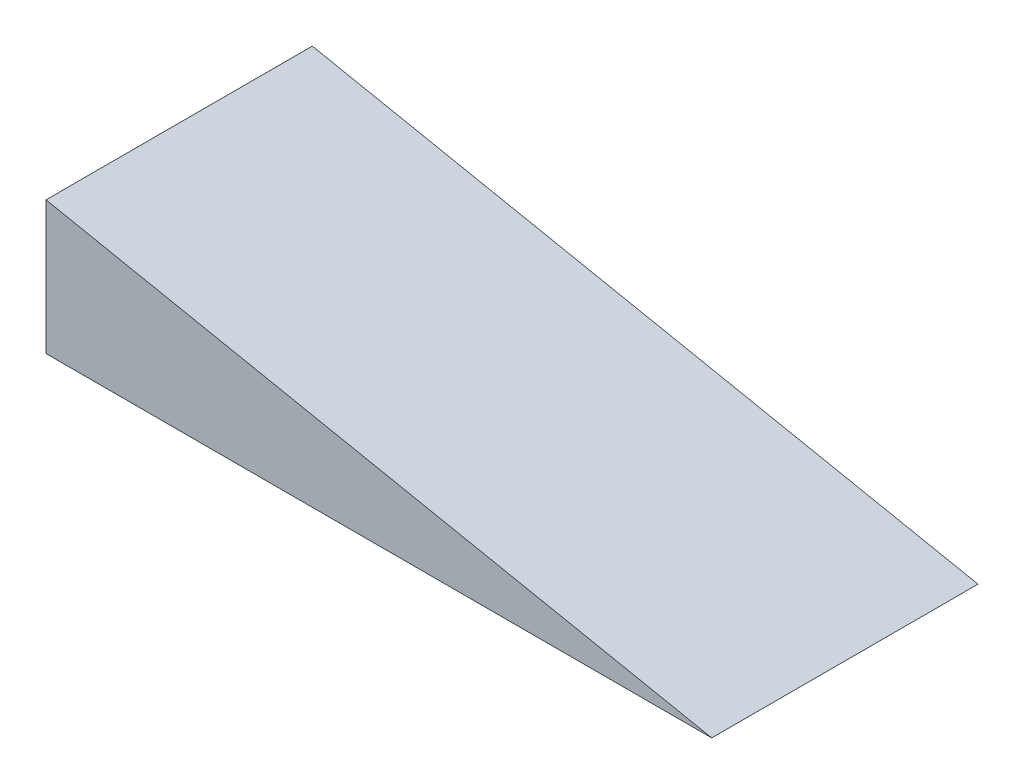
ISO-10303-21;
HEADER;
FILE_DESCRIPTION(('STEP AP214'),'2;1');
FILE_NAME('part.step','',(''),(''),'','','');
FILE_SCHEMA(('AUTOMOTIVE_DESIGN { 1 0 10303 214 1 1 1 1 }'));
ENDSEC;
DATA;
#1=APPLICATION_CONTEXT('core data for automotive mechanical design processes');
#2=APPLICATION_PROTOCOL_DEFINITION('international standard','automotive_design',2000,#1);
#3=PRODUCT_CONTEXT('',#1,'mechanical');
#4=PRODUCT('Part','Part','',(#3));
#5=PRODUCT_RELATED_PRODUCT_CATEGORY('part','',(#4));
#6=PRODUCT_DEFINITION_FORMATION('','',#4);
#7=PRODUCT_DEFINITION_CONTEXT('part definition',#1,'design');
#8=PRODUCT_DEFINITION('design','',#6,#7);
#9=PRODUCT_DEFINITION_SHAPE('','',#8);
#10=(LENGTH_UNIT() NAMED_UNIT(*) SI_UNIT(.MILLI.,.METRE.));
#11=(NAMED_UNIT(*) PLANE_ANGLE_UNIT() SI_UNIT($,.RADIAN.));
#12=(NAMED_UNIT(*) SI_UNIT($,.STERADIAN.) SOLID_ANGLE_UNIT());
#13=UNCERTAINTY_MEASURE_WITH_UNIT(LENGTH_MEASURE(1.E-05),#10,'distance_accuracy_value','');
#14=(GEOMETRIC_REPRESENTATION_CONTEXT(3) GLOBAL_UNCERTAINTY_ASSIGNED_CONTEXT((#13)) GLOBAL_UNIT_ASSIGNED_CONTEXT((#10,
#11,#12)) REPRESENTATION_CONTEXT('',''));
#15=CARTESIAN_POINT('',(0.,0.,0.));
#16=DIRECTION('',(0.,0.,1.));
#17=DIRECTION('',(1.,0.,0.));
#18=AXIS2_PLACEMENT_3D('',#15,#16,#17);
#19=CARTESIAN_POINT('',(0.,0.,4.));
#20=DIRECTION('',(1.,0.,0.));
#21=DIRECTION('',(0.,0.,-1.));
#22=AXIS2_PLACEMENT_3D('',#19,#20,#21);
#23=PLANE('',#22);
#24=DIRECTION('',(0.,-1.,0.));
#25=VECTOR('',#24,1.);
#26=CARTESIAN_POINT('',(0.,0.,0.));
#27=LINE('',#26,#25);
#28=CARTESIAN_POINT('',(0.,2.,0.));
#29=VERTEX_POINT('',#28);
#30=CARTESIAN_POINT('',(0.,0.,0.));
#31=VERTEX_POINT('',#30);
#32=EDGE_CURVE('E93',#29,#31,#27,.T.);
#33=ORIENTED_EDGE('',*,*,#32,.T.);
#34=DIRECTION('',(0.,0.,-1.));
#35=VECTOR('',#34,1.);
#36=CARTESIAN_POINT('',(0.,0.,4.));
#37=LINE('',#36,#35);
#38=CARTESIAN_POINT('',(0.,0.,4.));
#39=VERTEX_POINT('',#38);
#40=EDGE_CURVE('E11',#39,#31,#37,.T.);
#41=ORIENTED_EDGE('',*,*,#40,.F.);
#42=DIRECTION('',(0.,-1.,0.));
#43=VECTOR('',#42,1.);
#44=CARTESIAN_POINT('',(0.,0.,4.));
#45=LINE('',#44,#43);
#46=CARTESIAN_POINT('',(0.,2.,4.));
#47=VERTEX_POINT('',#46);
#48=EDGE_CURVE('E85',#47,#39,#45,.T.);
#49=ORIENTED_EDGE('',*,*,#48,.F.);
#50=DIRECTION('',(0.,0.,-1.));
#51=VECTOR('',#50,1.);
#52=CARTESIAN_POINT('',(0.,2.,4.));
#53=LINE('',#52,#51);
#54=EDGE_CURVE('E94',#47,#29,#53,.T.);
#55=ORIENTED_EDGE('',*,*,#54,.T.);
#56=EDGE_LOOP('',(#33,#41,#49,#55));
#57=FACE_BOUND('',#56,.T.);
#58=ADVANCED_FACE('F43',(#57),#23,.F.);
#59=CARTESIAN_POINT('',(0.,0.,4.));
#60=DIRECTION('',(0.,1.,0.));
#61=DIRECTION('',(0.,0.,1.));
#62=AXIS2_PLACEMENT_3D('',#59,#60,#61);
#63=PLANE('',#62);
#64=DIRECTION('',(1.,0.,0.));
#65=VECTOR('',#64,1.);
#66=CARTESIAN_POINT('',(0.,0.,0.));
#67=LINE('',#66,#65);
#68=CARTESIAN_POINT('',(10.,0.,0.));
#69=VERTEX_POINT('',#68);
#70=EDGE_CURVE('E72',#31,#69,#67,.T.);
#71=ORIENTED_EDGE('',*,*,#70,.T.);
#72=DIRECTION('',(0.,0.,-1.));
#73=VECTOR('',#72,1.);
#74=CARTESIAN_POINT('',(10.,0.,4.));
#75=LINE('',#74,#73);
#76=CARTESIAN_POINT('',(10.,0.,4.));
#77=VERTEX_POINT('',#76);
#78=EDGE_CURVE('E52',#77,#69,#75,.T.);
#79=ORIENTED_EDGE('',*,*,#78,.F.);
#80=DIRECTION('',(1.,0.,0.));
#81=VECTOR('',#80,1.);
#82=CARTESIAN_POINT('',(0.,0.,4.));
#83=LINE('',#82,#81);
#84=EDGE_CURVE('E80',#39,#77,#83,.T.);
#85=ORIENTED_EDGE('',*,*,#84,.F.);
#86=ORIENTED_EDGE('',*,*,#40,.T.);
#87=EDGE_LOOP('',(#71,#79,#85,#86));
#88=FACE_BOUND('',#87,.T.);
#89=ADVANCED_FACE('F81',(#88),#63,.F.);
#90=CARTESIAN_POINT('',(0.,2.,4.));
#91=DIRECTION('',(-0.196116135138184,-0.98058067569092,0.));
#92=DIRECTION('',(0.98058067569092,-0.196116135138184,0.));
#93=AXIS2_PLACEMENT_3D('',#90,#91,#92);
#94=PLANE('',#93);
#95=DIRECTION('',(-0.98058067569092,0.196116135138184,0.));
#96=VECTOR('',#95,1.);
#97=CARTESIAN_POINT('',(0.,2.,0.));
#98=LINE('',#97,#96);
#99=EDGE_CURVE('E77',#69,#29,#98,.T.);
#100=ORIENTED_EDGE('',*,*,#99,.T.);
#101=ORIENTED_EDGE('',*,*,#54,.F.);
#102=DIRECTION('',(-0.98058067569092,0.196116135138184,0.));
#103=VECTOR('',#102,1.);
#104=CARTESIAN_POINT('',(0.,2.,4.));
#105=LINE('',#104,#103);
#106=EDGE_CURVE('E60',#77,#47,#105,.T.);
#107=ORIENTED_EDGE('',*,*,#106,.F.);
#108=ORIENTED_EDGE('',*,*,#78,.T.);
#109=EDGE_LOOP('',(#100,#101,#107,#108));
#110=FACE_BOUND('',#109,.T.);
#111=ADVANCED_FACE('F106',(#110),#94,.F.);
#112=CARTESIAN_POINT('',(0.,0.,4.));
#113=DIRECTION('',(0.,0.,-1.));
#114=DIRECTION('',(-1.,0.,0.));
#115=AXIS2_PLACEMENT_3D('',#112,#113,#114);
#116=PLANE('',#115);
#117=ORIENTED_EDGE('',*,*,#48,.T.);
#118=ORIENTED_EDGE('',*,*,#84,.T.);
#119=ORIENTED_EDGE('',*,*,#106,.T.);
#120=EDGE_LOOP('',(#117,#118,#119));
#121=FACE_BOUND('',#120,.T.);
#122=ADVANCED_FACE('F88',(#121),#116,.F.);
#123=CARTESIAN_POINT('',(0.,0.,0.));
#124=DIRECTION('',(0.,0.,-1.));
#125=DIRECTION('',(-1.,0.,0.));
#126=AXIS2_PLACEMENT_3D('',#123,#124,#125);
#127=PLANE('',#126);
#128=ORIENTED_EDGE('',*,*,#32,.F.);
#129=ORIENTED_EDGE('',*,*,#99,.F.);
#130=ORIENTED_EDGE('',*,*,#70,.F.);
#131=EDGE_LOOP('',(#128,#129,#130));
#132=FACE_BOUND('',#131,.T.);
#133=ADVANCED_FACE('F107',(#132),#127,.T.);
#134=CLOSED_SHELL('',(#58,#89,#111,#122,#133));
#135=MANIFOLD_SOLID_BREP('B2',#134);
#136=ADVANCED_BREP_SHAPE_REPRESENTATION('',(#18,#135),#14);
#137=SHAPE_DEFINITION_REPRESENTATION(#9,#136);
ENDSEC;
END-ISO-10303-21;
